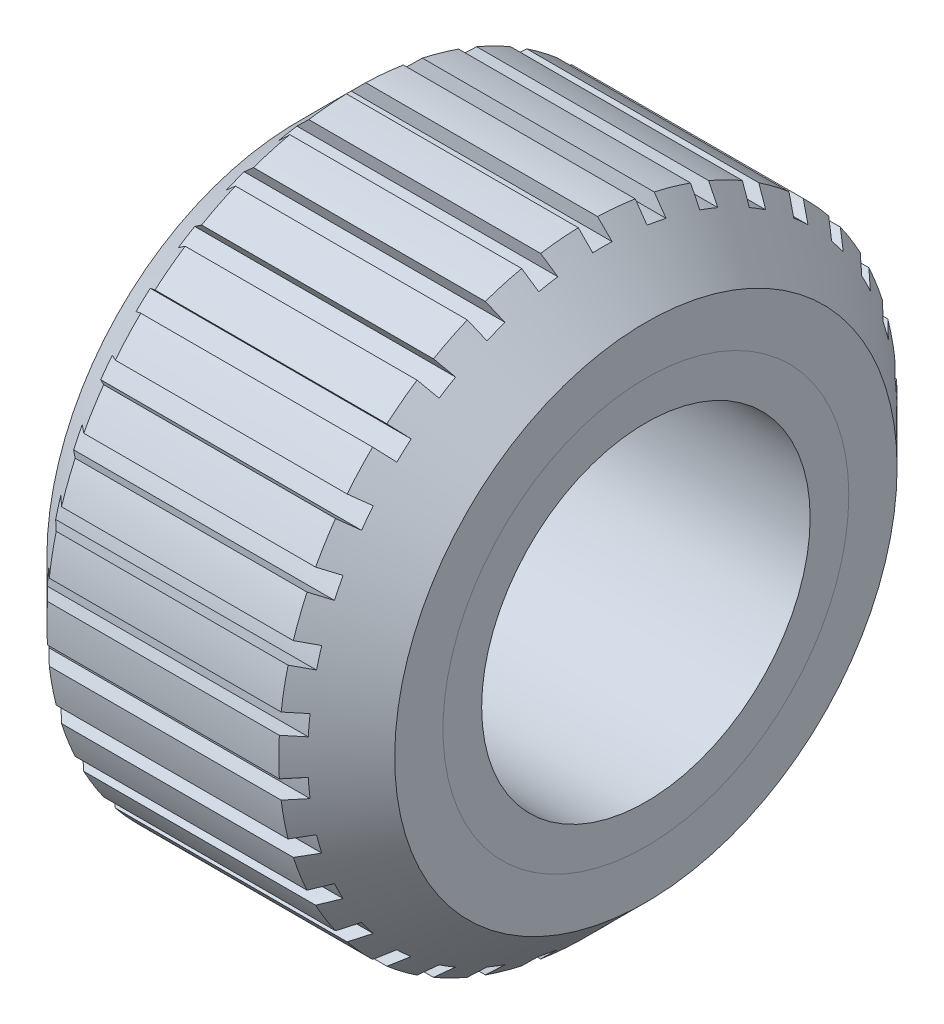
from build123d import *
from build123d.topology import SkipClean

# Parameters (mm, degrees)
SKETCH1_R           = 16
BOSS_EXTRUDE1_DEPTH = 18
SKETCH2_R           = 1.5
CUT_EXTRUDE1_DEPTH  = 4
CHAMFER1_SIZE       = 3
CUT_EXTRUDE2_DEPTH  = 29.91366459
SKETCH4_R           = 8.5
CUT_EXTRUDE3_DEPTH  = 13
CUT_EXTRUDE4_DEPTH  = 27.091186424


with BuildPart() as part:
    # Sketch1 → Boss-Extrude1 (new body)
    with BuildSketch(Plane(origin=(0, 0, 0), x_dir=(0, 0, -1), z_dir=(1, 0, 0))):
        Circle(SKETCH1_R)
    extrude(amount=BOSS_EXTRUDE1_DEPTH)

    # Sketch2 → Cut-Extrude1 (cut)
    with BuildSketch(Plane.ZY):
        Circle(SKETCH2_R)
    extrude(amount=-CUT_EXTRUDE1_DEPTH, mode=Mode.SUBTRACT)

    # Chamfer1
    chamfer1_edges = [part.edges().sort_by_distance(p)[0] for p in [
        (0, 0, 16),
        (18, 0, 16),
    ]]
    chamfer(chamfer1_edges, length=CHAMFER1_SIZE)

    # Sketch3 → Cut-Extrude2 (cut, through all)
    with BuildSketch(Plane(origin=(0, 0, 0), x_dir=(0, 0, -1), z_dir=(1, 0, 0))):
        with BuildLine():
            Line((0.5, 15.241801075), (0.5, 15.992185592))
            ThreePointArc((0.5, 15.992185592), (0, 16), (-0.5, 15.992185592))
            Line((-0.5, 15.992185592), (-0.5, 15.241801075))
            ThreePointArc((-0.5, 15.241801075), (0, 15.25), (0.5, 15.241801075))
        make_face()
        with BuildLine():
            Line((2.309187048, 15.074155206), (2.447069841, 15.811763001))
            ThreePointArc((2.447069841, 15.811763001), (2.939992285, 15.727569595), (3.430042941, 15.628013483))
            Line((3.430042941, 15.628013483), (3.292160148, 14.890405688))
            ThreePointArc((3.292160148, 14.890405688), (2.802180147, 14.99033977), (2.309187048, 15.074155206))
        make_face()
        with BuildLine():
            Line((5.039737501, 14.393177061), (5.310807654, 15.092889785))
            ThreePointArc((5.310807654, 15.092889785), (5.779866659, 14.91955567), (6.243279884, 14.731648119))
            Line((6.243279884, 14.731648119), (5.972209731, 14.031935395))
            ThreePointArc((5.972209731, 14.031935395), (5.508935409, 14.220201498), (5.039737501, 14.393177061))
        make_face()
        with BuildLine():
            Line((7.598665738, 13.222056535), (7.993692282, 13.860046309))
            ThreePointArc((7.993692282, 13.860046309), (8.422914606, 13.603474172), (8.843909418, 13.333614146))
            Line((8.843909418, 13.333614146), (8.448882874, 12.695624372))
            ThreePointArc((8.448882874, 12.695624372), (8.028090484, 12.96581132), (7.598665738, 13.222056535))
        make_face()
        with BuildLine():
            Line((9.898830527, 11.600674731), (10.404361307, 12.15521558))
            ThreePointArc((10.404361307, 12.15521558), (10.779130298, 11.824142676), (11.143370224, 11.481519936))
            Line((11.143370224, 11.481519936), (10.637839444, 10.926979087))
            ThreePointArc((10.637839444, 10.926979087), (10.273858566, 11.269885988), (9.898830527, 11.600674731))
        make_face()
        with BuildLine():
            Line((11.861902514, 9.584245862), (12.460722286, 10.036453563))
            ThreePointArc((12.460722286, 10.036453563), (12.768275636, 9.642154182), (13.063356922, 9.238436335))
            Line((13.063356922, 9.238436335), (12.464537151, 8.786228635))
            ThreePointArc((12.464537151, 8.786228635), (12.169762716, 9.190178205), (11.861902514, 9.584245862))
        make_face()
        with BuildLine():
            Line((13.421031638, 7.241436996), (14.092748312, 7.575912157))
            ThreePointArc((14.092748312, 7.575912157), (14.322612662, 7.131813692), (14.538486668, 6.680748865))
            Line((14.538486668, 6.680748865), (13.866769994, 6.346273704))
            ThreePointArc((13.866769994, 6.346273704), (13.651240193, 6.797509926), (13.421031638, 7.241436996))
        make_face()
        with BuildLine():
            Line((14.523123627, 4.652029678), (15.244862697, 4.857382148))
            ThreePointArc((15.244862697, 4.857382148), (15.389210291, 4.378607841), (15.518525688, 3.895556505))
            Line((15.518525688, 3.895556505), (14.796786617, 3.690204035))
            ThreePointArc((14.796786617, 3.690204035), (14.667841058, 4.173360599), (14.523123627, 4.652029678))
        make_face()
        with BuildLine():
            Line((15.130648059, 1.904203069), (15.877831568, 1.973439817))
            ThreePointArc((15.877831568, 1.973439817), (15.931746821, 1.476293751), (15.970099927, 0.977705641))
            Line((15.970099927, 0.977705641), (15.222916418, 0.908468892))
            ThreePointArc((15.222916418, 0.908468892), (15.184946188, 1.407092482), (15.130648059, 1.904203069))
        make_face()
        with BuildLine():
            Line((15.222916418, -0.908468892), (15.970099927, -0.977705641))
            ThreePointArc((15.970099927, -0.977705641), (15.931746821, -1.476293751), (15.877831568, -1.973439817))
            Line((15.877831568, -1.973439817), (15.130648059, -1.904203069))
            ThreePointArc((15.130648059, -1.904203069), (15.184946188, -1.407092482), (15.222916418, -0.908468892))
        make_face()
        with BuildLine():
            Line((14.796786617, -3.690204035), (15.518525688, -3.895556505))
            ThreePointArc((15.518525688, -3.895556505), (15.389210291, -4.378607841), (15.244862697, -4.857382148))
            Line((15.244862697, -4.857382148), (14.523123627, -4.652029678))
            ThreePointArc((14.523123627, -4.652029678), (14.667841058, -4.173360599), (14.796786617, -3.690204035))
        make_face()
        with BuildLine():
            Line((13.866769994, -6.346273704), (14.538486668, -6.680748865))
            ThreePointArc((14.538486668, -6.680748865), (14.322612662, -7.131813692), (14.092748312, -7.575912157))
            Line((14.092748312, -7.575912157), (13.421031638, -7.241436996))
            ThreePointArc((13.421031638, -7.241436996), (13.651240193, -6.797509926), (13.866769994, -6.346273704))
        make_face()
        with BuildLine():
            Line((12.464537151, -8.786228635), (13.063356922, -9.238436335))
            ThreePointArc((13.063356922, -9.238436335), (12.768275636, -9.642154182), (12.460722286, -10.036453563))
            Line((12.460722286, -10.036453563), (11.861902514, -9.584245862))
            ThreePointArc((11.861902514, -9.584245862), (12.169762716, -9.190178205), (12.464537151, -8.786228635))
        make_face()
        with BuildLine():
            Line((10.637839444, -10.926979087), (11.143370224, -11.481519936))
            ThreePointArc((11.143370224, -11.481519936), (10.779130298, -11.824142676), (10.404361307, -12.15521558))
            Line((10.404361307, -12.15521558), (9.898830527, -11.600674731))
            ThreePointArc((9.898830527, -11.600674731), (10.273858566, -11.269885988), (10.637839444, -10.926979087))
        make_face()
        with BuildLine():
            Line((8.448882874, -12.695624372), (8.843909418, -13.333614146))
            ThreePointArc((8.843909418, -13.333614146), (8.422914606, -13.603474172), (7.993692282, -13.860046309))
            Line((7.993692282, -13.860046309), (7.598665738, -13.222056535))
            ThreePointArc((7.598665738, -13.222056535), (8.028090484, -12.96581132), (8.448882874, -12.695624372))
        make_face()
        with BuildLine():
            Line((5.972209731, -14.031935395), (6.243279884, -14.731648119))
            ThreePointArc((6.243279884, -14.731648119), (5.779866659, -14.91955567), (5.310807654, -15.092889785))
            Line((5.310807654, -15.092889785), (5.039737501, -14.393177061))
            ThreePointArc((5.039737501, -14.393177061), (5.508935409, -14.220201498), (5.972209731, -14.031935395))
        make_face()
        with BuildLine():
            Line((3.292160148, -14.890405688), (3.430042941, -15.628013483))
            ThreePointArc((3.430042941, -15.628013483), (2.939992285, -15.727569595), (2.447069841, -15.811763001))
            Line((2.447069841, -15.811763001), (2.309187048, -15.074155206))
            ThreePointArc((2.309187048, -15.074155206), (2.802180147, -14.99033977), (3.292160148, -14.890405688))
        make_face()
        with BuildLine():
            Line((0.5, -15.241801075), (0.5, -15.992185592))
            ThreePointArc((0.5, -15.992185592), (0, -16), (-0.5, -15.992185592))
            Line((-0.5, -15.992185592), (-0.5, -15.241801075))
            ThreePointArc((-0.5, -15.241801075), (0, -15.25), (0.5, -15.241801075))
        make_face()
        with BuildLine():
            Line((-2.309187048, -15.074155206), (-2.447069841, -15.811763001))
            ThreePointArc((-2.447069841, -15.811763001), (-2.939992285, -15.727569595), (-3.430042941, -15.628013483))
            Line((-3.430042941, -15.628013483), (-3.292160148, -14.890405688))
            ThreePointArc((-3.292160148, -14.890405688), (-2.802180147, -14.99033977), (-2.309187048, -15.074155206))
        make_face()
        with BuildLine():
            Line((-5.039737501, -14.393177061), (-5.310807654, -15.092889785))
            ThreePointArc((-5.310807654, -15.092889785), (-5.779866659, -14.91955567), (-6.243279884, -14.731648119))
            Line((-6.243279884, -14.731648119), (-5.972209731, -14.031935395))
            ThreePointArc((-5.972209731, -14.031935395), (-5.508935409, -14.220201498), (-5.039737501, -14.393177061))
        make_face()
        with BuildLine():
            Line((-7.598665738, -13.222056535), (-7.993692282, -13.860046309))
            ThreePointArc((-7.993692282, -13.860046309), (-8.422914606, -13.603474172), (-8.843909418, -13.333614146))
            Line((-8.843909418, -13.333614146), (-8.448882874, -12.695624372))
            ThreePointArc((-8.448882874, -12.695624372), (-8.028090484, -12.96581132), (-7.598665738, -13.222056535))
        make_face()
        with BuildLine():
            Line((-9.898830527, -11.600674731), (-10.404361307, -12.15521558))
            ThreePointArc((-10.404361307, -12.15521558), (-10.779130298, -11.824142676), (-11.143370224, -11.481519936))
            Line((-11.143370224, -11.481519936), (-10.637839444, -10.926979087))
            ThreePointArc((-10.637839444, -10.926979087), (-10.273858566, -11.269885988), (-9.898830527, -11.600674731))
        make_face()
        with BuildLine():
            Line((-11.861902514, -9.584245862), (-12.460722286, -10.036453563))
            ThreePointArc((-12.460722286, -10.036453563), (-12.768275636, -9.642154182), (-13.063356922, -9.238436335))
            Line((-13.063356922, -9.238436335), (-12.464537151, -8.786228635))
            ThreePointArc((-12.464537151, -8.786228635), (-12.169762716, -9.190178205), (-11.861902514, -9.584245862))
        make_face()
        with BuildLine():
            Line((-13.421031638, -7.241436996), (-14.092748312, -7.575912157))
            ThreePointArc((-14.092748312, -7.575912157), (-14.322612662, -7.131813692), (-14.538486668, -6.680748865))
            Line((-14.538486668, -6.680748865), (-13.866769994, -6.346273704))
            ThreePointArc((-13.866769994, -6.346273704), (-13.651240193, -6.797509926), (-13.421031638, -7.241436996))
        make_face()
        with BuildLine():
            Line((-14.523123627, -4.652029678), (-15.244862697, -4.857382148))
            ThreePointArc((-15.244862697, -4.857382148), (-15.389210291, -4.378607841), (-15.518525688, -3.895556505))
            Line((-15.518525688, -3.895556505), (-14.796786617, -3.690204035))
            ThreePointArc((-14.796786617, -3.690204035), (-14.667841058, -4.173360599), (-14.523123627, -4.652029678))
        make_face()
        with BuildLine():
            Line((-15.130648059, -1.904203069), (-15.877831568, -1.973439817))
            ThreePointArc((-15.877831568, -1.973439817), (-15.931746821, -1.476293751), (-15.970099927, -0.977705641))
            Line((-15.970099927, -0.977705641), (-15.222916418, -0.908468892))
            ThreePointArc((-15.222916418, -0.908468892), (-15.184946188, -1.407092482), (-15.130648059, -1.904203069))
        make_face()
        with BuildLine():
            Line((-15.222916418, 0.908468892), (-15.970099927, 0.977705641))
            ThreePointArc((-15.970099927, 0.977705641), (-15.931746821, 1.476293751), (-15.877831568, 1.973439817))
            Line((-15.877831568, 1.973439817), (-15.130648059, 1.904203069))
            ThreePointArc((-15.130648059, 1.904203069), (-15.184946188, 1.407092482), (-15.222916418, 0.908468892))
        make_face()
        with BuildLine():
            Line((-14.796786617, 3.690204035), (-15.518525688, 3.895556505))
            ThreePointArc((-15.518525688, 3.895556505), (-15.389210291, 4.378607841), (-15.244862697, 4.857382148))
            Line((-15.244862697, 4.857382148), (-14.523123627, 4.652029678))
            ThreePointArc((-14.523123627, 4.652029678), (-14.667841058, 4.173360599), (-14.796786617, 3.690204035))
        make_face()
        with BuildLine():
            Line((-13.866769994, 6.346273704), (-14.538486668, 6.680748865))
            ThreePointArc((-14.538486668, 6.680748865), (-14.322612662, 7.131813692), (-14.092748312, 7.575912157))
            Line((-14.092748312, 7.575912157), (-13.421031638, 7.241436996))
            ThreePointArc((-13.421031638, 7.241436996), (-13.651240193, 6.797509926), (-13.866769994, 6.346273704))
        make_face()
        with BuildLine():
            Line((-12.464537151, 8.786228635), (-13.063356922, 9.238436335))
            ThreePointArc((-13.063356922, 9.238436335), (-12.768275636, 9.642154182), (-12.460722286, 10.036453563))
            Line((-12.460722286, 10.036453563), (-11.861902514, 9.584245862))
            ThreePointArc((-11.861902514, 9.584245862), (-12.169762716, 9.190178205), (-12.464537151, 8.786228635))
        make_face()
        with BuildLine():
            Line((-10.637839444, 10.926979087), (-11.143370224, 11.481519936))
            ThreePointArc((-11.143370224, 11.481519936), (-10.779130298, 11.824142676), (-10.404361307, 12.15521558))
            Line((-10.404361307, 12.15521558), (-9.898830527, 11.600674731))
            ThreePointArc((-9.898830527, 11.600674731), (-10.273858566, 11.269885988), (-10.637839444, 10.926979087))
        make_face()
        with BuildLine():
            Line((-8.448882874, 12.695624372), (-8.843909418, 13.333614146))
            ThreePointArc((-8.843909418, 13.333614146), (-8.422914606, 13.603474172), (-7.993692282, 13.860046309))
            Line((-7.993692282, 13.860046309), (-7.598665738, 13.222056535))
            ThreePointArc((-7.598665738, 13.222056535), (-8.028090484, 12.96581132), (-8.448882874, 12.695624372))
        make_face()
        with BuildLine():
            Line((-5.972209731, 14.031935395), (-6.243279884, 14.731648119))
            ThreePointArc((-6.243279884, 14.731648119), (-5.779866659, 14.91955567), (-5.310807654, 15.092889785))
            Line((-5.310807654, 15.092889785), (-5.039737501, 14.393177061))
            ThreePointArc((-5.039737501, 14.393177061), (-5.508935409, 14.220201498), (-5.972209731, 14.031935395))
        make_face()
        with BuildLine():
            Line((-3.292160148, 14.890405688), (-3.430042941, 15.628013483))
            ThreePointArc((-3.430042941, 15.628013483), (-2.939992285, 15.727569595), (-2.447069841, 15.811763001))
            Line((-2.447069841, 15.811763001), (-2.309187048, 15.074155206))
            ThreePointArc((-2.309187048, 15.074155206), (-2.802180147, 14.99033977), (-3.292160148, 14.890405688))
        make_face()
    extrude(amount=CUT_EXTRUDE2_DEPTH, mode=Mode.SUBTRACT)

    # Sketch4 → Cut-Extrude3 (cut)
    with BuildSketch(Plane(origin=(18, 0, 0), x_dir=(0, 0, -1), z_dir=(1, 0, 0))):
        Circle(SKETCH4_R)
    extrude(amount=-CUT_EXTRUDE3_DEPTH, mode=Mode.SUBTRACT)

    # Sketch5 → Cut-Extrude4 (cut, through all)
    with SkipClean():  # the faces are left unmerged after this step: merging them gives an invalid solid
        with BuildSketch(Plane(origin=(5, 0, 0), x_dir=(0, 0, -1), z_dir=(1, 0, 0))):
            with BuildLine():
                Line((1, 4.898979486), (1, 8.440971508))
                ThreePointArc((1, 8.440971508), (6.01040764, 6.01040764), (8.440971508, 1))
                Line((8.440971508, 1), (4.898979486, 1))
                ThreePointArc((4.898979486, 1), (3.535533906, 3.535533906), (1, 4.898979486))
            make_face()
            with BuildLine():
                Line((-1, 4.898979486), (-1, 8.440971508))
                ThreePointArc((-1, 8.440971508), (-6.01040764, 6.01040764), (-8.440971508, 1))
                Line((-8.440971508, 1), (-4.898979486, 1))
                ThreePointArc((-4.898979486, 1), (-3.535533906, 3.535533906), (-1, 4.898979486))
            make_face()
            with BuildLine():
                Line((4.898979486, -1), (8.440971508, -1))
                ThreePointArc((8.440971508, -1), (6.01040764, -6.01040764), (1, -8.440971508))
                Line((1, -8.440971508), (1, -4.898979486))
                ThreePointArc((1, -4.898979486), (3.535533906, -3.535533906), (4.898979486, -1))
            make_face()
            with BuildLine():
                Line((-1, -4.898979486), (-1, -8.440971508))
                ThreePointArc((-1, -8.440971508), (-6.01040764, -6.01040764), (-8.440971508, -1))
                Line((-8.440971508, -1), (-4.898979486, -1))
                ThreePointArc((-4.898979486, -1), (-3.535533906, -3.535533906), (-1, -4.898979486))
            make_face()
        extrude(amount=-CUT_EXTRUDE4_DEPTH, mode=Mode.SUBTRACT)


solid = part.part
